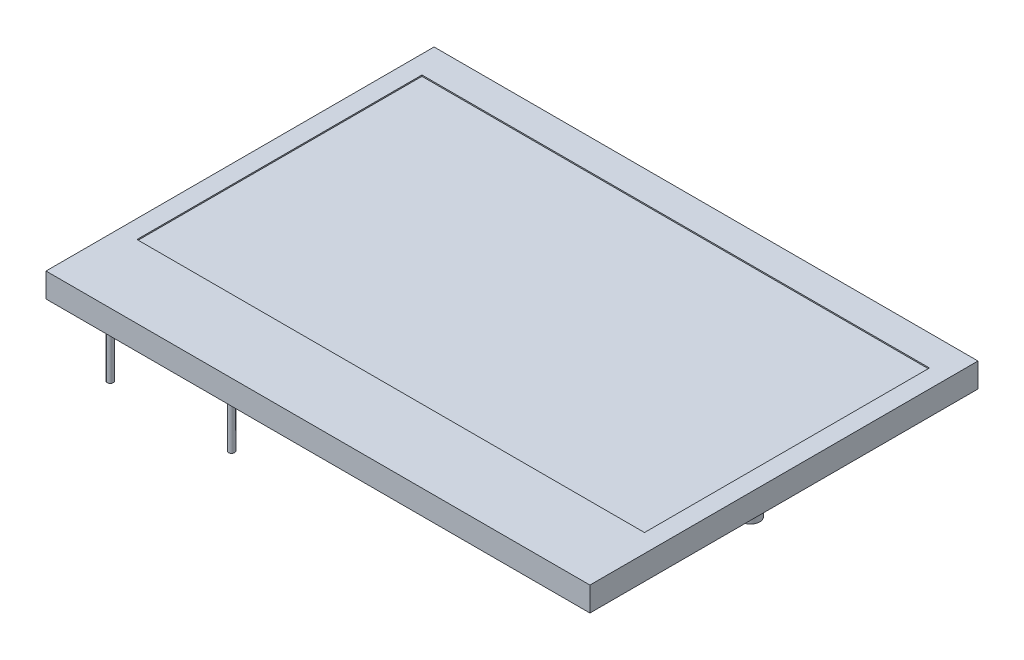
ISO-10303-21;
HEADER;
FILE_DESCRIPTION(('STEP AP214'),'2;1');
FILE_NAME('part.step','',(''),(''),'','','');
FILE_SCHEMA(('AUTOMOTIVE_DESIGN { 1 0 10303 214 1 1 1 1 }'));
ENDSEC;
DATA;
#1=APPLICATION_CONTEXT('core data for automotive mechanical design processes');
#2=APPLICATION_PROTOCOL_DEFINITION('international standard','automotive_design',2000,#1);
#3=PRODUCT_CONTEXT('',#1,'mechanical');
#4=PRODUCT('Part','Part','',(#3));
#5=PRODUCT_RELATED_PRODUCT_CATEGORY('part','',(#4));
#6=PRODUCT_DEFINITION_FORMATION('','',#4);
#7=PRODUCT_DEFINITION_CONTEXT('part definition',#1,'design');
#8=PRODUCT_DEFINITION('design','',#6,#7);
#9=PRODUCT_DEFINITION_SHAPE('','',#8);
#10=(LENGTH_UNIT() NAMED_UNIT(*) SI_UNIT(.MILLI.,.METRE.));
#11=(NAMED_UNIT(*) PLANE_ANGLE_UNIT() SI_UNIT($,.RADIAN.));
#12=(NAMED_UNIT(*) SI_UNIT($,.STERADIAN.) SOLID_ANGLE_UNIT());
#13=UNCERTAINTY_MEASURE_WITH_UNIT(LENGTH_MEASURE(1.E-05),#10,'distance_accuracy_value','');
#14=(GEOMETRIC_REPRESENTATION_CONTEXT(3) GLOBAL_UNCERTAINTY_ASSIGNED_CONTEXT((#13)) GLOBAL_UNIT_ASSIGNED_CONTEXT((#10,
#11,#12)) REPRESENTATION_CONTEXT('',''));
#15=CARTESIAN_POINT('',(0.,0.,0.));
#16=DIRECTION('',(0.,0.,1.));
#17=DIRECTION('',(1.,0.,0.));
#18=AXIS2_PLACEMENT_3D('',#15,#16,#17);
#19=CARTESIAN_POINT('',(22.425,2.5,-14.5));
#20=DIRECTION('',(0.,-1.,0.));
#21=DIRECTION('',(0.,0.,-1.));
#22=AXIS2_PLACEMENT_3D('',#19,#20,#21);
#23=PLANE('',#22);
#24=CARTESIAN_POINT('',(-18.425,2.5,16.2));
#25=DIRECTION('',(0.,-1.,0.));
#26=DIRECTION('',(0.,0.,-1.));
#27=AXIS2_PLACEMENT_3D('',#24,#25,#26);
#28=CIRCLE('',#27,0.25);
#29=CARTESIAN_POINT('',(-18.425,2.5,15.95));
#30=VERTEX_POINT('',#29);
#31=EDGE_CURVE('E402',#30,#30,#28,.T.);
#32=ORIENTED_EDGE('',*,*,#31,.F.);
#33=EDGE_LOOP('',(#32));
#34=FACE_BOUND('',#33,.T.);
#35=CARTESIAN_POINT('',(-18.17,2.5,0.));
#36=DIRECTION('',(0.,-1.,0.));
#37=DIRECTION('',(0.,0.,-1.));
#38=AXIS2_PLACEMENT_3D('',#35,#36,#37);
#39=CIRCLE('',#38,1.5);
#40=CARTESIAN_POINT('',(-18.17,2.5,-1.5));
#41=VERTEX_POINT('',#40);
#42=EDGE_CURVE('E133',#41,#41,#39,.T.);
#43=ORIENTED_EDGE('',*,*,#42,.F.);
#44=EDGE_LOOP('',(#43));
#45=FACE_BOUND('',#44,.T.);
#46=DIRECTION('',(0.,0.,-1.));
#47=VECTOR('',#46,1.);
#48=CARTESIAN_POINT('',(22.425,2.5,17.5));
#49=LINE('',#48,#47);
#50=CARTESIAN_POINT('',(22.425,2.5,17.5));
#51=VERTEX_POINT('',#50);
#52=CARTESIAN_POINT('',(22.425,2.5,-14.5));
#53=VERTEX_POINT('',#52);
#54=EDGE_CURVE('E146',#51,#53,#49,.T.);
#55=ORIENTED_EDGE('',*,*,#54,.F.);
#56=DIRECTION('',(1.,0.,0.));
#57=VECTOR('',#56,1.);
#58=CARTESIAN_POINT('',(-22.425,2.5,17.5));
#59=LINE('',#58,#57);
#60=CARTESIAN_POINT('',(-22.425,2.5,17.5));
#61=VERTEX_POINT('',#60);
#62=EDGE_CURVE('E77',#61,#51,#59,.T.);
#63=ORIENTED_EDGE('',*,*,#62,.F.);
#64=DIRECTION('',(0.,0.,1.));
#65=VECTOR('',#64,1.);
#66=CARTESIAN_POINT('',(-22.425,2.5,17.5));
#67=LINE('',#66,#65);
#68=CARTESIAN_POINT('',(-22.425,2.5,-14.5));
#69=VERTEX_POINT('',#68);
#70=EDGE_CURVE('E161',#69,#61,#67,.T.);
#71=ORIENTED_EDGE('',*,*,#70,.F.);
#72=DIRECTION('',(-1.,0.,0.));
#73=VECTOR('',#72,1.);
#74=CARTESIAN_POINT('',(-22.425,2.5,-14.5));
#75=LINE('',#74,#73);
#76=EDGE_CURVE('E159',#53,#69,#75,.T.);
#77=ORIENTED_EDGE('',*,*,#76,.F.);
#78=EDGE_LOOP('',(#55,#63,#71,#77));
#79=FACE_BOUND('',#78,.T.);
#80=CARTESIAN_POINT('',(18.17,2.5,0.));
#81=DIRECTION('',(0.,-1.,0.));
#82=DIRECTION('',(0.,0.,1.));
#83=AXIS2_PLACEMENT_3D('',#80,#81,#82);
#84=CIRCLE('',#83,1.5);
#85=CARTESIAN_POINT('',(18.17,2.5,1.50000000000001));
#86=VERTEX_POINT('',#85);
#87=EDGE_CURVE('E420',#86,#86,#84,.T.);
#88=ORIENTED_EDGE('',*,*,#87,.F.);
#89=EDGE_LOOP('',(#88));
#90=FACE_BOUND('',#89,.T.);
#91=CARTESIAN_POINT('',(-8.425,2.5,16.2));
#92=DIRECTION('',(0.,-1.,0.));
#93=DIRECTION('',(0.,0.,-1.));
#94=AXIS2_PLACEMENT_3D('',#91,#92,#93);
#95=CIRCLE('',#94,0.25);
#96=CARTESIAN_POINT('',(-8.425,2.5,15.95));
#97=VERTEX_POINT('',#96);
#98=EDGE_CURVE('E403',#97,#97,#95,.T.);
#99=ORIENTED_EDGE('',*,*,#98,.F.);
#100=EDGE_LOOP('',(#99));
#101=FACE_BOUND('',#100,.T.);
#102=ADVANCED_FACE('F32',(#34,#45,#79,#90,#101),#23,.T.);
#103=CARTESIAN_POINT('',(18.17,0.,0.));
#104=DIRECTION('',(0.,1.,0.));
#105=DIRECTION('',(0.,0.,1.));
#106=AXIS2_PLACEMENT_3D('',#103,#104,#105);
#107=PLANE('',#106);
#108=CARTESIAN_POINT('',(18.17,0.,0.));
#109=DIRECTION('',(0.,-1.,0.));
#110=DIRECTION('',(0.,0.,1.));
#111=AXIS2_PLACEMENT_3D('',#108,#109,#110);
#112=CIRCLE('',#111,1.5);
#113=CARTESIAN_POINT('',(18.17,0.,1.50000000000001));
#114=VERTEX_POINT('',#113);
#115=EDGE_CURVE('E423',#114,#114,#112,.T.);
#116=ORIENTED_EDGE('',*,*,#115,.T.);
#117=EDGE_LOOP('',(#116));
#118=FACE_BOUND('',#117,.T.);
#119=CARTESIAN_POINT('',(18.17,0.,0.));
#120=DIRECTION('',(0.,1.,0.));
#121=DIRECTION('',(0.,0.,1.));
#122=AXIS2_PLACEMENT_3D('',#119,#120,#121);
#123=CIRCLE('',#122,0.750000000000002);
#124=CARTESIAN_POINT('',(18.17,0.,0.750000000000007));
#125=VERTEX_POINT('',#124);
#126=EDGE_CURVE('E11',#125,#125,#123,.F.);
#127=ORIENTED_EDGE('',*,*,#126,.F.);
#128=EDGE_LOOP('',(#127));
#129=FACE_BOUND('',#128,.T.);
#130=ADVANCED_FACE('F195',(#118,#129),#107,.F.);
#131=CARTESIAN_POINT('',(-18.17,0.,0.));
#132=DIRECTION('',(0.,-1.,0.));
#133=DIRECTION('',(0.,0.,-1.));
#134=AXIS2_PLACEMENT_3D('',#131,#132,#133);
#135=PLANE('',#134);
#136=CARTESIAN_POINT('',(-18.17,0.,0.));
#137=DIRECTION('',(0.,-1.,0.));
#138=DIRECTION('',(0.,0.,-1.));
#139=AXIS2_PLACEMENT_3D('',#136,#137,#138);
#140=CIRCLE('',#139,1.5);
#141=CARTESIAN_POINT('',(-18.17,0.,-1.5));
#142=VERTEX_POINT('',#141);
#143=EDGE_CURVE('E140',#142,#142,#140,.T.);
#144=ORIENTED_EDGE('',*,*,#143,.T.);
#145=EDGE_LOOP('',(#144));
#146=FACE_BOUND('',#145,.T.);
#147=CARTESIAN_POINT('',(-18.17,0.,0.));
#148=DIRECTION('',(0.,-1.,0.));
#149=DIRECTION('',(0.,0.,-1.));
#150=AXIS2_PLACEMENT_3D('',#147,#148,#149);
#151=CIRCLE('',#150,0.750000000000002);
#152=CARTESIAN_POINT('',(-18.17,0.,-0.750000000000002));
#153=VERTEX_POINT('',#152);
#154=EDGE_CURVE('E416',#153,#153,#151,.T.);
#155=ORIENTED_EDGE('',*,*,#154,.F.);
#156=EDGE_LOOP('',(#155));
#157=FACE_BOUND('',#156,.T.);
#158=ADVANCED_FACE('F200',(#146,#157),#135,.T.);
#159=CARTESIAN_POINT('',(22.425,4.5,17.5));
#160=DIRECTION('',(-1.,0.,0.));
#161=DIRECTION('',(0.,0.,1.));
#162=AXIS2_PLACEMENT_3D('',#159,#160,#161);
#163=PLANE('',#162);
#164=ORIENTED_EDGE('',*,*,#54,.T.);
#165=DIRECTION('',(0.,-1.,0.));
#166=VECTOR('',#165,1.);
#167=CARTESIAN_POINT('',(22.425,4.5,-14.5));
#168=LINE('',#167,#166);
#169=CARTESIAN_POINT('',(22.425,4.5,-14.5));
#170=VERTEX_POINT('',#169);
#171=EDGE_CURVE('E40',#170,#53,#168,.T.);
#172=ORIENTED_EDGE('',*,*,#171,.F.);
#173=DIRECTION('',(0.,0.,-1.));
#174=VECTOR('',#173,1.);
#175=CARTESIAN_POINT('',(22.425,4.5,17.5));
#176=LINE('',#175,#174);
#177=CARTESIAN_POINT('',(22.425,4.5,17.5));
#178=VERTEX_POINT('',#177);
#179=EDGE_CURVE('E150',#178,#170,#176,.T.);
#180=ORIENTED_EDGE('',*,*,#179,.F.);
#181=DIRECTION('',(0.,-1.,0.));
#182=VECTOR('',#181,1.);
#183=CARTESIAN_POINT('',(22.425,4.5,17.5));
#184=LINE('',#183,#182);
#185=EDGE_CURVE('E156',#178,#51,#184,.T.);
#186=ORIENTED_EDGE('',*,*,#185,.T.);
#187=EDGE_LOOP('',(#164,#172,#180,#186));
#188=FACE_BOUND('',#187,.T.);
#189=ADVANCED_FACE('F34',(#188),#163,.F.);
#190=CARTESIAN_POINT('',(-22.425,4.5,-14.5));
#191=DIRECTION('',(0.,0.,1.));
#192=DIRECTION('',(1.,0.,0.));
#193=AXIS2_PLACEMENT_3D('',#190,#191,#192);
#194=PLANE('',#193);
#195=ORIENTED_EDGE('',*,*,#76,.T.);
#196=DIRECTION('',(0.,-1.,0.));
#197=VECTOR('',#196,1.);
#198=CARTESIAN_POINT('',(-22.425,4.5,-14.5));
#199=LINE('',#198,#197);
#200=CARTESIAN_POINT('',(-22.425,4.5,-14.5));
#201=VERTEX_POINT('',#200);
#202=EDGE_CURVE('E167',#201,#69,#199,.T.);
#203=ORIENTED_EDGE('',*,*,#202,.F.);
#204=DIRECTION('',(-1.,0.,0.));
#205=VECTOR('',#204,1.);
#206=CARTESIAN_POINT('',(-22.425,4.5,-14.5));
#207=LINE('',#206,#205);
#208=EDGE_CURVE('E85',#170,#201,#207,.T.);
#209=ORIENTED_EDGE('',*,*,#208,.F.);
#210=ORIENTED_EDGE('',*,*,#171,.T.);
#211=EDGE_LOOP('',(#195,#203,#209,#210));
#212=FACE_BOUND('',#211,.T.);
#213=ADVANCED_FACE('F170',(#212),#194,.F.);
#214=CARTESIAN_POINT('',(-22.425,4.5,17.5));
#215=DIRECTION('',(1.,0.,0.));
#216=DIRECTION('',(0.,0.,-1.));
#217=AXIS2_PLACEMENT_3D('',#214,#215,#216);
#218=PLANE('',#217);
#219=ORIENTED_EDGE('',*,*,#70,.T.);
#220=DIRECTION('',(0.,-1.,0.));
#221=VECTOR('',#220,1.);
#222=CARTESIAN_POINT('',(-22.425,4.5,17.5));
#223=LINE('',#222,#221);
#224=CARTESIAN_POINT('',(-22.425,4.5,17.5));
#225=VERTEX_POINT('',#224);
#226=EDGE_CURVE('E165',#225,#61,#223,.T.);
#227=ORIENTED_EDGE('',*,*,#226,.F.);
#228=DIRECTION('',(0.,0.,1.));
#229=VECTOR('',#228,1.);
#230=CARTESIAN_POINT('',(-22.425,4.5,17.5));
#231=LINE('',#230,#229);
#232=EDGE_CURVE('E153',#201,#225,#231,.T.);
#233=ORIENTED_EDGE('',*,*,#232,.F.);
#234=ORIENTED_EDGE('',*,*,#202,.T.);
#235=EDGE_LOOP('',(#219,#227,#233,#234));
#236=FACE_BOUND('',#235,.T.);
#237=ADVANCED_FACE('F179',(#236),#218,.F.);
#238=CARTESIAN_POINT('',(-22.425,4.5,17.5));
#239=DIRECTION('',(0.,0.,-1.));
#240=DIRECTION('',(-1.,0.,0.));
#241=AXIS2_PLACEMENT_3D('',#238,#239,#240);
#242=PLANE('',#241);
#243=ORIENTED_EDGE('',*,*,#62,.T.);
#244=ORIENTED_EDGE('',*,*,#185,.F.);
#245=DIRECTION('',(1.,0.,0.));
#246=VECTOR('',#245,1.);
#247=CARTESIAN_POINT('',(-22.425,4.5,17.5));
#248=LINE('',#247,#246);
#249=EDGE_CURVE('E56',#225,#178,#248,.T.);
#250=ORIENTED_EDGE('',*,*,#249,.F.);
#251=ORIENTED_EDGE('',*,*,#226,.T.);
#252=EDGE_LOOP('',(#243,#244,#250,#251));
#253=FACE_BOUND('',#252,.T.);
#254=ADVANCED_FACE('F181',(#253),#242,.F.);
#255=CARTESIAN_POINT('',(22.425,4.5,-14.5));
#256=DIRECTION('',(0.,-1.,0.));
#257=DIRECTION('',(0.,0.,-1.));
#258=AXIS2_PLACEMENT_3D('',#255,#256,#257);
#259=PLANE('',#258);
#260=DIRECTION('',(1.,0.,0.));
#261=VECTOR('',#260,1.);
#262=CARTESIAN_POINT('',(-20.925,4.5,11.5));
#263=LINE('',#262,#261);
#264=CARTESIAN_POINT('',(-20.925,4.5,11.5));
#265=VERTEX_POINT('',#264);
#266=CARTESIAN_POINT('',(20.925,4.5,11.5));
#267=VERTEX_POINT('',#266);
#268=EDGE_CURVE('E139',#265,#267,#263,.T.);
#269=ORIENTED_EDGE('',*,*,#268,.F.);
#270=DIRECTION('',(0.,0.,1.));
#271=VECTOR('',#270,1.);
#272=CARTESIAN_POINT('',(-20.925,4.5,-12.));
#273=LINE('',#272,#271);
#274=CARTESIAN_POINT('',(-20.925,4.5,-12.));
#275=VERTEX_POINT('',#274);
#276=EDGE_CURVE('E47',#275,#265,#273,.T.);
#277=ORIENTED_EDGE('',*,*,#276,.F.);
#278=DIRECTION('',(-1.,0.,0.));
#279=VECTOR('',#278,1.);
#280=CARTESIAN_POINT('',(-20.925,4.5,-12.));
#281=LINE('',#280,#279);
#282=CARTESIAN_POINT('',(20.925,4.5,-12.));
#283=VERTEX_POINT('',#282);
#284=EDGE_CURVE('E127',#283,#275,#281,.T.);
#285=ORIENTED_EDGE('',*,*,#284,.F.);
#286=DIRECTION('',(0.,0.,-1.));
#287=VECTOR('',#286,1.);
#288=CARTESIAN_POINT('',(20.925,4.5,-12.));
#289=LINE('',#288,#287);
#290=EDGE_CURVE('E130',#267,#283,#289,.T.);
#291=ORIENTED_EDGE('',*,*,#290,.F.);
#292=EDGE_LOOP('',(#269,#277,#285,#291));
#293=FACE_BOUND('',#292,.T.);
#294=ORIENTED_EDGE('',*,*,#179,.T.);
#295=ORIENTED_EDGE('',*,*,#208,.T.);
#296=ORIENTED_EDGE('',*,*,#232,.T.);
#297=ORIENTED_EDGE('',*,*,#249,.T.);
#298=EDGE_LOOP('',(#294,#295,#296,#297));
#299=FACE_BOUND('',#298,.T.);
#300=ADVANCED_FACE('F182',(#293,#299),#259,.F.);
#301=CARTESIAN_POINT('',(-20.925,4.4,-12.));
#302=DIRECTION('',(-1.,0.,0.));
#303=DIRECTION('',(0.,0.,1.));
#304=AXIS2_PLACEMENT_3D('',#301,#302,#303);
#305=PLANE('',#304);
#306=ORIENTED_EDGE('',*,*,#276,.T.);
#307=DIRECTION('',(0.,1.,0.));
#308=VECTOR('',#307,1.);
#309=CARTESIAN_POINT('',(-20.925,4.4,11.5));
#310=LINE('',#309,#308);
#311=CARTESIAN_POINT('',(-20.925,4.4,11.5));
#312=VERTEX_POINT('',#311);
#313=EDGE_CURVE('E105',#312,#265,#310,.T.);
#314=ORIENTED_EDGE('',*,*,#313,.F.);
#315=DIRECTION('',(0.,0.,1.));
#316=VECTOR('',#315,1.);
#317=CARTESIAN_POINT('',(-20.925,4.4,-12.));
#318=LINE('',#317,#316);
#319=CARTESIAN_POINT('',(-20.925,4.4,-12.));
#320=VERTEX_POINT('',#319);
#321=EDGE_CURVE('E109',#320,#312,#318,.T.);
#322=ORIENTED_EDGE('',*,*,#321,.F.);
#323=DIRECTION('',(0.,1.,0.));
#324=VECTOR('',#323,1.);
#325=CARTESIAN_POINT('',(-20.925,4.4,-12.));
#326=LINE('',#325,#324);
#327=EDGE_CURVE('E144',#320,#275,#326,.T.);
#328=ORIENTED_EDGE('',*,*,#327,.T.);
#329=EDGE_LOOP('',(#306,#314,#322,#328));
#330=FACE_BOUND('',#329,.T.);
#331=ADVANCED_FACE('F107',(#330),#305,.F.);
#332=CARTESIAN_POINT('',(-20.925,4.4,-12.));
#333=DIRECTION('',(0.,0.,-1.));
#334=DIRECTION('',(-1.,0.,0.));
#335=AXIS2_PLACEMENT_3D('',#332,#333,#334);
#336=PLANE('',#335);
#337=ORIENTED_EDGE('',*,*,#284,.T.);
#338=ORIENTED_EDGE('',*,*,#327,.F.);
#339=DIRECTION('',(-1.,0.,0.));
#340=VECTOR('',#339,1.);
#341=CARTESIAN_POINT('',(-20.925,4.4,-12.));
#342=LINE('',#341,#340);
#343=CARTESIAN_POINT('',(20.925,4.4,-12.));
#344=VERTEX_POINT('',#343);
#345=EDGE_CURVE('E115',#344,#320,#342,.T.);
#346=ORIENTED_EDGE('',*,*,#345,.F.);
#347=DIRECTION('',(0.,1.,0.));
#348=VECTOR('',#347,1.);
#349=CARTESIAN_POINT('',(20.925,4.4,-12.));
#350=LINE('',#349,#348);
#351=EDGE_CURVE('E147',#344,#283,#350,.T.);
#352=ORIENTED_EDGE('',*,*,#351,.T.);
#353=EDGE_LOOP('',(#337,#338,#346,#352));
#354=FACE_BOUND('',#353,.T.);
#355=ADVANCED_FACE('F190',(#354),#336,.F.);
#356=CARTESIAN_POINT('',(20.925,4.4,-12.));
#357=DIRECTION('',(1.,0.,0.));
#358=DIRECTION('',(0.,0.,-1.));
#359=AXIS2_PLACEMENT_3D('',#356,#357,#358);
#360=PLANE('',#359);
#361=ORIENTED_EDGE('',*,*,#290,.T.);
#362=ORIENTED_EDGE('',*,*,#351,.F.);
#363=DIRECTION('',(0.,0.,-1.));
#364=VECTOR('',#363,1.);
#365=CARTESIAN_POINT('',(20.925,4.4,-12.));
#366=LINE('',#365,#364);
#367=CARTESIAN_POINT('',(20.925,4.4,11.5));
#368=VERTEX_POINT('',#367);
#369=EDGE_CURVE('E123',#368,#344,#366,.T.);
#370=ORIENTED_EDGE('',*,*,#369,.F.);
#371=DIRECTION('',(0.,1.,0.));
#372=VECTOR('',#371,1.);
#373=CARTESIAN_POINT('',(20.925,4.4,11.5));
#374=LINE('',#373,#372);
#375=EDGE_CURVE('E114',#368,#267,#374,.T.);
#376=ORIENTED_EDGE('',*,*,#375,.T.);
#377=EDGE_LOOP('',(#361,#362,#370,#376));
#378=FACE_BOUND('',#377,.T.);
#379=ADVANCED_FACE('F231',(#378),#360,.F.);
#380=CARTESIAN_POINT('',(-20.925,4.4,11.5));
#381=DIRECTION('',(0.,0.,1.));
#382=DIRECTION('',(1.,0.,0.));
#383=AXIS2_PLACEMENT_3D('',#380,#381,#382);
#384=PLANE('',#383);
#385=ORIENTED_EDGE('',*,*,#268,.T.);
#386=ORIENTED_EDGE('',*,*,#375,.F.);
#387=DIRECTION('',(1.,0.,0.));
#388=VECTOR('',#387,1.);
#389=CARTESIAN_POINT('',(-20.925,4.4,11.5));
#390=LINE('',#389,#388);
#391=EDGE_CURVE('E118',#312,#368,#390,.T.);
#392=ORIENTED_EDGE('',*,*,#391,.F.);
#393=ORIENTED_EDGE('',*,*,#313,.T.);
#394=EDGE_LOOP('',(#385,#386,#392,#393));
#395=FACE_BOUND('',#394,.T.);
#396=ADVANCED_FACE('F119',(#395),#384,.F.);
#397=CARTESIAN_POINT('',(-20.925,4.4,11.5));
#398=DIRECTION('',(0.,1.,0.));
#399=DIRECTION('',(0.,0.,1.));
#400=AXIS2_PLACEMENT_3D('',#397,#398,#399);
#401=PLANE('',#400);
#402=ORIENTED_EDGE('',*,*,#321,.T.);
#403=ORIENTED_EDGE('',*,*,#391,.T.);
#404=ORIENTED_EDGE('',*,*,#369,.T.);
#405=ORIENTED_EDGE('',*,*,#345,.T.);
#406=EDGE_LOOP('',(#402,#403,#404,#405));
#407=FACE_BOUND('',#406,.T.);
#408=ADVANCED_FACE('F125',(#407),#401,.T.);
#409=CARTESIAN_POINT('',(-18.17,0.,0.));
#410=DIRECTION('',(0.,1.,0.));
#411=DIRECTION('',(0.,0.,1.));
#412=AXIS2_PLACEMENT_3D('',#409,#410,#411);
#413=CYLINDRICAL_SURFACE('',#412,1.5);
#414=ORIENTED_EDGE('',*,*,#143,.F.);
#415=EDGE_LOOP('',(#414));
#416=FACE_BOUND('',#415,.T.);
#417=ORIENTED_EDGE('',*,*,#42,.T.);
#418=EDGE_LOOP('',(#417));
#419=FACE_BOUND('',#418,.T.);
#420=ADVANCED_FACE('F223',(#416,#419),#413,.T.);
#421=CARTESIAN_POINT('',(18.17,0.,0.));
#422=DIRECTION('',(0.,1.,0.));
#423=DIRECTION('',(0.,0.,1.));
#424=AXIS2_PLACEMENT_3D('',#421,#422,#423);
#425=CYLINDRICAL_SURFACE('',#424,1.5);
#426=ORIENTED_EDGE('',*,*,#115,.F.);
#427=EDGE_LOOP('',(#426));
#428=FACE_BOUND('',#427,.T.);
#429=ORIENTED_EDGE('',*,*,#87,.T.);
#430=EDGE_LOOP('',(#429));
#431=FACE_BOUND('',#430,.T.);
#432=ADVANCED_FACE('F222',(#428,#431),#425,.T.);
#433=CARTESIAN_POINT('',(-18.17,-1.5,0.));
#434=DIRECTION('',(0.,1.,0.));
#435=DIRECTION('',(0.,0.,1.));
#436=AXIS2_PLACEMENT_3D('',#433,#434,#435);
#437=CYLINDRICAL_SURFACE('',#436,0.750000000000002);
#438=CARTESIAN_POINT('',(-18.17,-1.5,0.));
#439=DIRECTION('',(0.,-1.,0.));
#440=DIRECTION('',(0.,0.,-1.));
#441=AXIS2_PLACEMENT_3D('',#438,#439,#440);
#442=CIRCLE('',#441,0.750000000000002);
#443=CARTESIAN_POINT('',(-18.17,-1.5,-0.750000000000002));
#444=VERTEX_POINT('',#443);
#445=EDGE_CURVE('E417',#444,#444,#442,.T.);
#446=ORIENTED_EDGE('',*,*,#445,.F.);
#447=EDGE_LOOP('',(#446));
#448=FACE_BOUND('',#447,.T.);
#449=ORIENTED_EDGE('',*,*,#154,.T.);
#450=EDGE_LOOP('',(#449));
#451=FACE_BOUND('',#450,.T.);
#452=ADVANCED_FACE('F255',(#448,#451),#437,.T.);
#453=CARTESIAN_POINT('',(-18.17,-1.5,0.));
#454=DIRECTION('',(0.,-1.,0.));
#455=DIRECTION('',(0.,0.,-1.));
#456=AXIS2_PLACEMENT_3D('',#453,#454,#455);
#457=PLANE('',#456);
#458=ORIENTED_EDGE('',*,*,#445,.T.);
#459=EDGE_LOOP('',(#458));
#460=FACE_BOUND('',#459,.T.);
#461=ADVANCED_FACE('F263',(#460),#457,.T.);
#462=CARTESIAN_POINT('',(18.17,-1.5,0.));
#463=DIRECTION('',(0.,1.,0.));
#464=DIRECTION('',(0.,0.,1.));
#465=AXIS2_PLACEMENT_3D('',#462,#463,#464);
#466=CYLINDRICAL_SURFACE('',#465,0.750000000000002);
#467=CARTESIAN_POINT('',(18.17,-1.5,0.));
#468=DIRECTION('',(0.,-1.,0.));
#469=DIRECTION('',(0.,0.,-1.));
#470=AXIS2_PLACEMENT_3D('',#467,#468,#469);
#471=CIRCLE('',#470,0.750000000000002);
#472=CARTESIAN_POINT('',(18.17,-1.5,-0.749999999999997));
#473=VERTEX_POINT('',#472);
#474=EDGE_CURVE('E412',#473,#473,#471,.T.);
#475=ORIENTED_EDGE('',*,*,#474,.F.);
#476=EDGE_LOOP('',(#475));
#477=FACE_BOUND('',#476,.T.);
#478=ORIENTED_EDGE('',*,*,#126,.T.);
#479=EDGE_LOOP('',(#478));
#480=FACE_BOUND('',#479,.T.);
#481=ADVANCED_FACE('F271',(#477,#480),#466,.T.);
#482=CARTESIAN_POINT('',(18.17,-1.5,0.));
#483=DIRECTION('',(0.,-1.,0.));
#484=DIRECTION('',(0.,0.,-1.));
#485=AXIS2_PLACEMENT_3D('',#482,#483,#484);
#486=PLANE('',#485);
#487=ORIENTED_EDGE('',*,*,#474,.T.);
#488=EDGE_LOOP('',(#487));
#489=FACE_BOUND('',#488,.T.);
#490=ADVANCED_FACE('F279',(#489),#486,.T.);
#491=CARTESIAN_POINT('',(-18.425,-2.,16.2));
#492=DIRECTION('',(0.,1.,0.));
#493=DIRECTION('',(0.,0.,1.));
#494=AXIS2_PLACEMENT_3D('',#491,#492,#493);
#495=CYLINDRICAL_SURFACE('',#494,0.25);
#496=CARTESIAN_POINT('',(-18.425,-2.,16.2));
#497=DIRECTION('',(0.,-1.,0.));
#498=DIRECTION('',(0.,0.,-1.));
#499=AXIS2_PLACEMENT_3D('',#496,#497,#498);
#500=CIRCLE('',#499,0.25);
#501=CARTESIAN_POINT('',(-18.425,-2.,15.95));
#502=VERTEX_POINT('',#501);
#503=EDGE_CURVE('E406',#502,#502,#500,.T.);
#504=ORIENTED_EDGE('',*,*,#503,.F.);
#505=EDGE_LOOP('',(#504));
#506=FACE_BOUND('',#505,.T.);
#507=ORIENTED_EDGE('',*,*,#31,.T.);
#508=EDGE_LOOP('',(#507));
#509=FACE_BOUND('',#508,.T.);
#510=ADVANCED_FACE('F287',(#506,#509),#495,.T.);
#511=CARTESIAN_POINT('',(-18.425,-2.,16.2));
#512=DIRECTION('',(0.,-1.,0.));
#513=DIRECTION('',(0.,0.,-1.));
#514=AXIS2_PLACEMENT_3D('',#511,#512,#513);
#515=PLANE('',#514);
#516=ORIENTED_EDGE('',*,*,#503,.T.);
#517=EDGE_LOOP('',(#516));
#518=FACE_BOUND('',#517,.T.);
#519=ADVANCED_FACE('F295',(#518),#515,.T.);
#520=CARTESIAN_POINT('',(-8.425,-2.,16.2));
#521=DIRECTION('',(0.,1.,0.));
#522=DIRECTION('',(0.,0.,1.));
#523=AXIS2_PLACEMENT_3D('',#520,#521,#522);
#524=CYLINDRICAL_SURFACE('',#523,0.25);
#525=CARTESIAN_POINT('',(-8.425,-2.,16.2));
#526=DIRECTION('',(0.,-1.,0.));
#527=DIRECTION('',(0.,0.,-1.));
#528=AXIS2_PLACEMENT_3D('',#525,#526,#527);
#529=CIRCLE('',#528,0.25);
#530=CARTESIAN_POINT('',(-8.425,-2.,15.95));
#531=VERTEX_POINT('',#530);
#532=EDGE_CURVE('E401',#531,#531,#529,.T.);
#533=ORIENTED_EDGE('',*,*,#532,.F.);
#534=EDGE_LOOP('',(#533));
#535=FACE_BOUND('',#534,.T.);
#536=ORIENTED_EDGE('',*,*,#98,.T.);
#537=EDGE_LOOP('',(#536));
#538=FACE_BOUND('',#537,.T.);
#539=ADVANCED_FACE('F303',(#535,#538),#524,.T.);
#540=CARTESIAN_POINT('',(-8.425,-2.,16.2));
#541=DIRECTION('',(0.,-1.,0.));
#542=DIRECTION('',(0.,0.,-1.));
#543=AXIS2_PLACEMENT_3D('',#540,#541,#542);
#544=PLANE('',#543);
#545=ORIENTED_EDGE('',*,*,#532,.T.);
#546=EDGE_LOOP('',(#545));
#547=FACE_BOUND('',#546,.T.);
#548=ADVANCED_FACE('F311',(#547),#544,.T.);
#549=CLOSED_SHELL('',(#102,#130,#158,#189,#213,#237,#254,#300,#331,#355,#379,#396,#408,#420,
#432,#452,#461,#481,#490,#510,#519,#539,#548));
#550=MANIFOLD_SOLID_BREP('B2',#549);
#551=ADVANCED_BREP_SHAPE_REPRESENTATION('',(#18,#550),#14);
#552=SHAPE_DEFINITION_REPRESENTATION(#9,#551);
ENDSEC;
END-ISO-10303-21;
